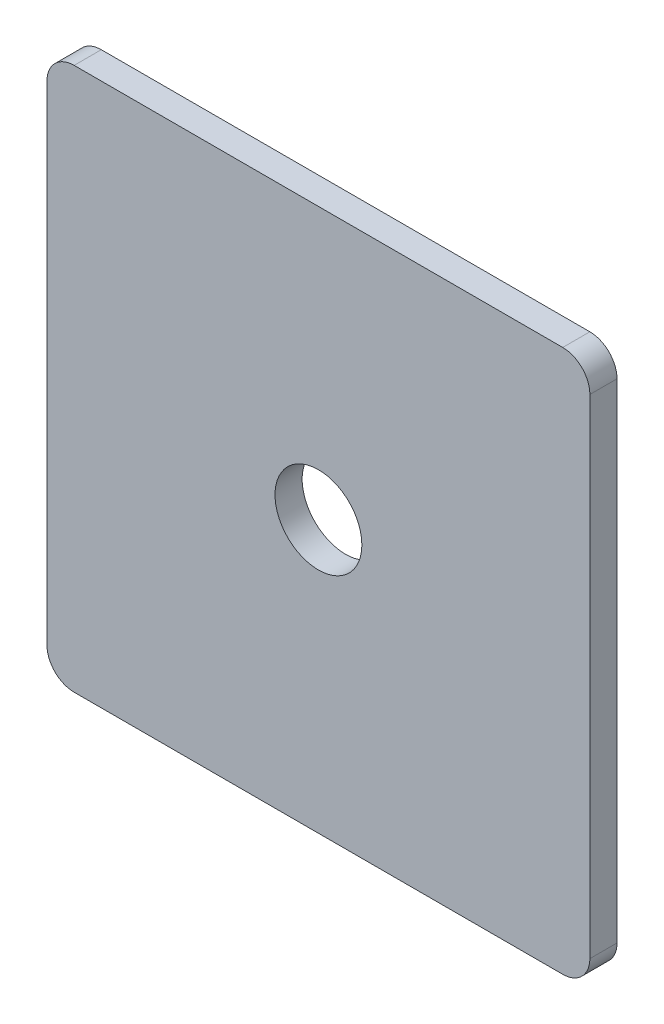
ISO-10303-21;
HEADER;
FILE_DESCRIPTION(('STEP AP214'),'2;1');
FILE_NAME('part.step','',(''),(''),'','','');
FILE_SCHEMA(('AUTOMOTIVE_DESIGN { 1 0 10303 214 1 1 1 1 }'));
ENDSEC;
DATA;
#1=APPLICATION_CONTEXT('core data for automotive mechanical design processes');
#2=APPLICATION_PROTOCOL_DEFINITION('international standard','automotive_design',2000,#1);
#3=PRODUCT_CONTEXT('',#1,'mechanical');
#4=PRODUCT('Part','Part','',(#3));
#5=PRODUCT_RELATED_PRODUCT_CATEGORY('part','',(#4));
#6=PRODUCT_DEFINITION_FORMATION('','',#4);
#7=PRODUCT_DEFINITION_CONTEXT('part definition',#1,'design');
#8=PRODUCT_DEFINITION('design','',#6,#7);
#9=PRODUCT_DEFINITION_SHAPE('','',#8);
#10=(LENGTH_UNIT() NAMED_UNIT(*) SI_UNIT(.MILLI.,.METRE.));
#11=(NAMED_UNIT(*) PLANE_ANGLE_UNIT() SI_UNIT($,.RADIAN.));
#12=(NAMED_UNIT(*) SI_UNIT($,.STERADIAN.) SOLID_ANGLE_UNIT());
#13=UNCERTAINTY_MEASURE_WITH_UNIT(LENGTH_MEASURE(1.E-05),#10,'distance_accuracy_value','');
#14=(GEOMETRIC_REPRESENTATION_CONTEXT(3) GLOBAL_UNCERTAINTY_ASSIGNED_CONTEXT((#13)) GLOBAL_UNIT_ASSIGNED_CONTEXT((#10,
#11,#12)) REPRESENTATION_CONTEXT('',''));
#15=CARTESIAN_POINT('',(0.,0.,0.));
#16=DIRECTION('',(0.,0.,1.));
#17=DIRECTION('',(1.,0.,0.));
#18=AXIS2_PLACEMENT_3D('',#15,#16,#17);
#19=CARTESIAN_POINT('',(0.,0.,5.));
#20=DIRECTION('',(1.,0.,0.));
#21=DIRECTION('',(0.,0.,-1.));
#22=AXIS2_PLACEMENT_3D('',#19,#20,#21);
#23=PLANE('',#22);
#24=DIRECTION('',(0.,-1.,0.));
#25=VECTOR('',#24,1.);
#26=CARTESIAN_POINT('',(0.,0.,0.));
#27=LINE('',#26,#25);
#28=CARTESIAN_POINT('',(0.,95.,0.));
#29=VERTEX_POINT('',#28);
#30=CARTESIAN_POINT('',(0.,5.,0.));
#31=VERTEX_POINT('',#30);
#32=EDGE_CURVE('E143',#29,#31,#27,.T.);
#33=ORIENTED_EDGE('',*,*,#32,.T.);
#34=DIRECTION('',(0.,0.,-1.));
#35=VECTOR('',#34,1.);
#36=CARTESIAN_POINT('',(0.,5.,5.));
#37=LINE('',#36,#35);
#38=CARTESIAN_POINT('',(0.,5.,5.));
#39=VERTEX_POINT('',#38);
#40=EDGE_CURVE('E119',#31,#39,#37,.F.);
#41=ORIENTED_EDGE('',*,*,#40,.T.);
#42=DIRECTION('',(0.,-1.,0.));
#43=VECTOR('',#42,1.);
#44=CARTESIAN_POINT('',(0.,0.,5.));
#45=LINE('',#44,#43);
#46=CARTESIAN_POINT('',(0.,95.,5.));
#47=VERTEX_POINT('',#46);
#48=EDGE_CURVE('E156',#47,#39,#45,.T.);
#49=ORIENTED_EDGE('',*,*,#48,.F.);
#50=DIRECTION('',(0.,0.,-1.));
#51=VECTOR('',#50,1.);
#52=CARTESIAN_POINT('',(0.,95.,5.));
#53=LINE('',#52,#51);
#54=EDGE_CURVE('E124',#47,#29,#53,.T.);
#55=ORIENTED_EDGE('',*,*,#54,.T.);
#56=EDGE_LOOP('',(#33,#41,#49,#55));
#57=FACE_BOUND('',#56,.T.);
#58=ADVANCED_FACE('F43',(#57),#23,.F.);
#59=CARTESIAN_POINT('',(0.,0.,5.));
#60=DIRECTION('',(0.,1.,0.));
#61=DIRECTION('',(0.,0.,1.));
#62=AXIS2_PLACEMENT_3D('',#59,#60,#61);
#63=PLANE('',#62);
#64=DIRECTION('',(1.,0.,0.));
#65=VECTOR('',#64,1.);
#66=CARTESIAN_POINT('',(0.,0.,5.));
#67=LINE('',#66,#65);
#68=CARTESIAN_POINT('',(5.,0.,5.));
#69=VERTEX_POINT('',#68);
#70=CARTESIAN_POINT('',(95.,0.,5.));
#71=VERTEX_POINT('',#70);
#72=EDGE_CURVE('E134',#69,#71,#67,.T.);
#73=ORIENTED_EDGE('',*,*,#72,.F.);
#74=DIRECTION('',(0.,0.,-1.));
#75=VECTOR('',#74,1.);
#76=CARTESIAN_POINT('',(5.,0.,5.));
#77=LINE('',#76,#75);
#78=CARTESIAN_POINT('',(5.,0.,0.));
#79=VERTEX_POINT('',#78);
#80=EDGE_CURVE('E118',#69,#79,#77,.T.);
#81=ORIENTED_EDGE('',*,*,#80,.T.);
#82=DIRECTION('',(1.,0.,0.));
#83=VECTOR('',#82,1.);
#84=CARTESIAN_POINT('',(0.,0.,0.));
#85=LINE('',#84,#83);
#86=CARTESIAN_POINT('',(95.,0.,0.));
#87=VERTEX_POINT('',#86);
#88=EDGE_CURVE('E131',#79,#87,#85,.T.);
#89=ORIENTED_EDGE('',*,*,#88,.T.);
#90=DIRECTION('',(0.,0.,-1.));
#91=VECTOR('',#90,1.);
#92=CARTESIAN_POINT('',(95.,0.,5.));
#93=LINE('',#92,#91);
#94=EDGE_CURVE('E136',#87,#71,#93,.F.);
#95=ORIENTED_EDGE('',*,*,#94,.T.);
#96=EDGE_LOOP('',(#73,#81,#89,#95));
#97=FACE_BOUND('',#96,.T.);
#98=ADVANCED_FACE('F130',(#97),#63,.F.);
#99=CARTESIAN_POINT('',(100.,0.,5.));
#100=DIRECTION('',(-1.,0.,0.));
#101=DIRECTION('',(0.,0.,1.));
#102=AXIS2_PLACEMENT_3D('',#99,#100,#101);
#103=PLANE('',#102);
#104=DIRECTION('',(0.,1.,0.));
#105=VECTOR('',#104,1.);
#106=CARTESIAN_POINT('',(100.,0.,5.));
#107=LINE('',#106,#105);
#108=CARTESIAN_POINT('',(100.,5.,5.));
#109=VERTEX_POINT('',#108);
#110=CARTESIAN_POINT('',(100.,95.,5.));
#111=VERTEX_POINT('',#110);
#112=EDGE_CURVE('E184',#109,#111,#107,.T.);
#113=ORIENTED_EDGE('',*,*,#112,.F.);
#114=DIRECTION('',(0.,0.,-1.));
#115=VECTOR('',#114,1.);
#116=CARTESIAN_POINT('',(100.,5.,5.));
#117=LINE('',#116,#115);
#118=CARTESIAN_POINT('',(100.,5.,0.));
#119=VERTEX_POINT('',#118);
#120=EDGE_CURVE('E11',#109,#119,#117,.T.);
#121=ORIENTED_EDGE('',*,*,#120,.T.);
#122=DIRECTION('',(0.,1.,0.));
#123=VECTOR('',#122,1.);
#124=CARTESIAN_POINT('',(100.,0.,0.));
#125=LINE('',#124,#123);
#126=CARTESIAN_POINT('',(100.,95.,0.));
#127=VERTEX_POINT('',#126);
#128=EDGE_CURVE('E142',#119,#127,#125,.T.);
#129=ORIENTED_EDGE('',*,*,#128,.T.);
#130=DIRECTION('',(0.,0.,-1.));
#131=VECTOR('',#130,1.);
#132=CARTESIAN_POINT('',(100.,95.,5.));
#133=LINE('',#132,#131);
#134=EDGE_CURVE('E51',#127,#111,#133,.F.);
#135=ORIENTED_EDGE('',*,*,#134,.T.);
#136=EDGE_LOOP('',(#113,#121,#129,#135));
#137=FACE_BOUND('',#136,.T.);
#138=ADVANCED_FACE('F183',(#137),#103,.F.);
#139=CARTESIAN_POINT('',(0.,100.,5.));
#140=DIRECTION('',(0.,-1.,0.));
#141=DIRECTION('',(0.,0.,-1.));
#142=AXIS2_PLACEMENT_3D('',#139,#140,#141);
#143=PLANE('',#142);
#144=DIRECTION('',(-1.,0.,0.));
#145=VECTOR('',#144,1.);
#146=CARTESIAN_POINT('',(0.,100.,0.));
#147=LINE('',#146,#145);
#148=CARTESIAN_POINT('',(95.,100.,0.));
#149=VERTEX_POINT('',#148);
#150=CARTESIAN_POINT('',(5.,100.,0.));
#151=VERTEX_POINT('',#150);
#152=EDGE_CURVE('E148',#149,#151,#147,.T.);
#153=ORIENTED_EDGE('',*,*,#152,.T.);
#154=DIRECTION('',(0.,0.,-1.));
#155=VECTOR('',#154,1.);
#156=CARTESIAN_POINT('',(5.,100.,5.));
#157=LINE('',#156,#155);
#158=CARTESIAN_POINT('',(5.,100.,5.));
#159=VERTEX_POINT('',#158);
#160=EDGE_CURVE('E58',#151,#159,#157,.F.);
#161=ORIENTED_EDGE('',*,*,#160,.T.);
#162=DIRECTION('',(-1.,0.,0.));
#163=VECTOR('',#162,1.);
#164=CARTESIAN_POINT('',(0.,100.,5.));
#165=LINE('',#164,#163);
#166=CARTESIAN_POINT('',(95.,100.,5.));
#167=VERTEX_POINT('',#166);
#168=EDGE_CURVE('E157',#167,#159,#165,.T.);
#169=ORIENTED_EDGE('',*,*,#168,.F.);
#170=DIRECTION('',(0.,0.,-1.));
#171=VECTOR('',#170,1.);
#172=CARTESIAN_POINT('',(95.,100.,5.));
#173=LINE('',#172,#171);
#174=EDGE_CURVE('E174',#167,#149,#173,.T.);
#175=ORIENTED_EDGE('',*,*,#174,.T.);
#176=EDGE_LOOP('',(#153,#161,#169,#175));
#177=FACE_BOUND('',#176,.T.);
#178=ADVANCED_FACE('F193',(#177),#143,.F.);
#179=CARTESIAN_POINT('',(0.,100.,5.));
#180=DIRECTION('',(0.,0.,-1.));
#181=DIRECTION('',(-1.,0.,0.));
#182=AXIS2_PLACEMENT_3D('',#179,#180,#181);
#183=PLANE('',#182);
#184=CARTESIAN_POINT('',(50.,50.,5.));
#185=DIRECTION('',(0.,0.,1.));
#186=DIRECTION('',(1.,0.,0.));
#187=AXIS2_PLACEMENT_3D('',#184,#185,#186);
#188=CIRCLE('',#187,8.);
#189=CARTESIAN_POINT('',(58.,50.,5.));
#190=VERTEX_POINT('',#189);
#191=EDGE_CURVE('E203',#190,#190,#188,.T.);
#192=ORIENTED_EDGE('',*,*,#191,.F.);
#193=EDGE_LOOP('',(#192));
#194=FACE_BOUND('',#193,.T.);
#195=ORIENTED_EDGE('',*,*,#48,.T.);
#196=CARTESIAN_POINT('',(5.,5.,5.));
#197=DIRECTION('',(0.,0.,-1.));
#198=DIRECTION('',(-1.,0.,0.));
#199=AXIS2_PLACEMENT_3D('',#196,#197,#198);
#200=CIRCLE('',#199,5.);
#201=EDGE_CURVE('E172',#39,#69,#200,.F.);
#202=ORIENTED_EDGE('',*,*,#201,.T.);
#203=ORIENTED_EDGE('',*,*,#72,.T.);
#204=CARTESIAN_POINT('',(95.,5.,5.));
#205=DIRECTION('',(0.,0.,-1.));
#206=DIRECTION('',(-1.,0.,0.));
#207=AXIS2_PLACEMENT_3D('',#204,#205,#206);
#208=CIRCLE('',#207,5.);
#209=EDGE_CURVE('E168',#71,#109,#208,.F.);
#210=ORIENTED_EDGE('',*,*,#209,.T.);
#211=ORIENTED_EDGE('',*,*,#112,.T.);
#212=CARTESIAN_POINT('',(95.,95.,5.));
#213=DIRECTION('',(0.,0.,-1.));
#214=DIRECTION('',(-1.,0.,0.));
#215=AXIS2_PLACEMENT_3D('',#212,#213,#214);
#216=CIRCLE('',#215,5.);
#217=EDGE_CURVE('E68',#111,#167,#216,.F.);
#218=ORIENTED_EDGE('',*,*,#217,.T.);
#219=ORIENTED_EDGE('',*,*,#168,.T.);
#220=CARTESIAN_POINT('',(5.,95.,5.));
#221=DIRECTION('',(0.,0.,-1.));
#222=DIRECTION('',(-1.,0.,0.));
#223=AXIS2_PLACEMENT_3D('',#220,#221,#222);
#224=CIRCLE('',#223,5.);
#225=EDGE_CURVE('E170',#159,#47,#224,.F.);
#226=ORIENTED_EDGE('',*,*,#225,.T.);
#227=EDGE_LOOP('',(#195,#202,#203,#210,#211,#218,#219,#226));
#228=FACE_BOUND('',#227,.T.);
#229=ADVANCED_FACE('F188',(#194,#228),#183,.F.);
#230=CARTESIAN_POINT('',(0.,100.,0.));
#231=DIRECTION('',(0.,0.,-1.));
#232=DIRECTION('',(-1.,0.,0.));
#233=AXIS2_PLACEMENT_3D('',#230,#231,#232);
#234=PLANE('',#233);
#235=CARTESIAN_POINT('',(50.,50.,0.));
#236=DIRECTION('',(0.,0.,1.));
#237=DIRECTION('',(1.,0.,0.));
#238=AXIS2_PLACEMENT_3D('',#235,#236,#237);
#239=CIRCLE('',#238,8.);
#240=CARTESIAN_POINT('',(58.,50.,0.));
#241=VERTEX_POINT('',#240);
#242=EDGE_CURVE('E150',#241,#241,#239,.T.);
#243=ORIENTED_EDGE('',*,*,#242,.T.);
#244=EDGE_LOOP('',(#243));
#245=FACE_BOUND('',#244,.T.);
#246=ORIENTED_EDGE('',*,*,#88,.F.);
#247=CARTESIAN_POINT('',(5.,5.,0.));
#248=DIRECTION('',(0.,0.,-1.));
#249=DIRECTION('',(-1.,0.,0.));
#250=AXIS2_PLACEMENT_3D('',#247,#248,#249);
#251=CIRCLE('',#250,5.);
#252=EDGE_CURVE('E114',#79,#31,#251,.T.);
#253=ORIENTED_EDGE('',*,*,#252,.T.);
#254=ORIENTED_EDGE('',*,*,#32,.F.);
#255=CARTESIAN_POINT('',(5.,95.,0.));
#256=DIRECTION('',(0.,0.,-1.));
#257=DIRECTION('',(-1.,0.,0.));
#258=AXIS2_PLACEMENT_3D('',#255,#256,#257);
#259=CIRCLE('',#258,5.);
#260=EDGE_CURVE('E125',#29,#151,#259,.T.);
#261=ORIENTED_EDGE('',*,*,#260,.T.);
#262=ORIENTED_EDGE('',*,*,#152,.F.);
#263=CARTESIAN_POINT('',(95.,95.,0.));
#264=DIRECTION('',(0.,0.,-1.));
#265=DIRECTION('',(-1.,0.,0.));
#266=AXIS2_PLACEMENT_3D('',#263,#264,#265);
#267=CIRCLE('',#266,5.);
#268=EDGE_CURVE('E135',#149,#127,#267,.T.);
#269=ORIENTED_EDGE('',*,*,#268,.T.);
#270=ORIENTED_EDGE('',*,*,#128,.F.);
#271=CARTESIAN_POINT('',(95.,5.,0.));
#272=DIRECTION('',(0.,0.,-1.));
#273=DIRECTION('',(-1.,0.,0.));
#274=AXIS2_PLACEMENT_3D('',#271,#272,#273);
#275=CIRCLE('',#274,5.);
#276=EDGE_CURVE('E140',#119,#87,#275,.T.);
#277=ORIENTED_EDGE('',*,*,#276,.T.);
#278=EDGE_LOOP('',(#246,#253,#254,#261,#262,#269,#270,#277));
#279=FACE_BOUND('',#278,.T.);
#280=ADVANCED_FACE('F138',(#245,#279),#234,.T.);
#281=CARTESIAN_POINT('',(50.,50.,0.));
#282=DIRECTION('',(0.,0.,1.));
#283=DIRECTION('',(1.,0.,0.));
#284=AXIS2_PLACEMENT_3D('',#281,#282,#283);
#285=CYLINDRICAL_SURFACE('',#284,8.);
#286=ORIENTED_EDGE('',*,*,#242,.F.);
#287=EDGE_LOOP('',(#286));
#288=FACE_BOUND('',#287,.T.);
#289=ORIENTED_EDGE('',*,*,#191,.T.);
#290=EDGE_LOOP('',(#289));
#291=FACE_BOUND('',#290,.T.);
#292=ADVANCED_FACE('F211',(#288,#291),#285,.F.);
#293=CARTESIAN_POINT('',(5.,5.,5.));
#294=DIRECTION('',(0.,0.,-1.));
#295=DIRECTION('',(-1.,0.,0.));
#296=AXIS2_PLACEMENT_3D('',#293,#294,#295);
#297=CYLINDRICAL_SURFACE('',#296,5.);
#298=ORIENTED_EDGE('',*,*,#201,.F.);
#299=ORIENTED_EDGE('',*,*,#40,.F.);
#300=ORIENTED_EDGE('',*,*,#252,.F.);
#301=ORIENTED_EDGE('',*,*,#80,.F.);
#302=EDGE_LOOP('',(#298,#299,#300,#301));
#303=FACE_BOUND('',#302,.T.);
#304=ADVANCED_FACE('F117',(#303),#297,.T.);
#305=CARTESIAN_POINT('',(5.,95.,5.));
#306=DIRECTION('',(0.,0.,-1.));
#307=DIRECTION('',(-1.,0.,0.));
#308=AXIS2_PLACEMENT_3D('',#305,#306,#307);
#309=CYLINDRICAL_SURFACE('',#308,5.);
#310=ORIENTED_EDGE('',*,*,#225,.F.);
#311=ORIENTED_EDGE('',*,*,#160,.F.);
#312=ORIENTED_EDGE('',*,*,#260,.F.);
#313=ORIENTED_EDGE('',*,*,#54,.F.);
#314=EDGE_LOOP('',(#310,#311,#312,#313));
#315=FACE_BOUND('',#314,.T.);
#316=ADVANCED_FACE('F197',(#315),#309,.T.);
#317=CARTESIAN_POINT('',(95.,5.,5.));
#318=DIRECTION('',(0.,0.,-1.));
#319=DIRECTION('',(-1.,0.,0.));
#320=AXIS2_PLACEMENT_3D('',#317,#318,#319);
#321=CYLINDRICAL_SURFACE('',#320,5.);
#322=ORIENTED_EDGE('',*,*,#209,.F.);
#323=ORIENTED_EDGE('',*,*,#94,.F.);
#324=ORIENTED_EDGE('',*,*,#276,.F.);
#325=ORIENTED_EDGE('',*,*,#120,.F.);
#326=EDGE_LOOP('',(#322,#323,#324,#325));
#327=FACE_BOUND('',#326,.T.);
#328=ADVANCED_FACE('F236',(#327),#321,.T.);
#329=CARTESIAN_POINT('',(95.,95.,5.));
#330=DIRECTION('',(0.,0.,-1.));
#331=DIRECTION('',(-1.,0.,0.));
#332=AXIS2_PLACEMENT_3D('',#329,#330,#331);
#333=CYLINDRICAL_SURFACE('',#332,5.);
#334=ORIENTED_EDGE('',*,*,#217,.F.);
#335=ORIENTED_EDGE('',*,*,#134,.F.);
#336=ORIENTED_EDGE('',*,*,#268,.F.);
#337=ORIENTED_EDGE('',*,*,#174,.F.);
#338=EDGE_LOOP('',(#334,#335,#336,#337));
#339=FACE_BOUND('',#338,.T.);
#340=ADVANCED_FACE('F45',(#339),#333,.T.);
#341=CLOSED_SHELL('',(#58,#98,#138,#178,#229,#280,#292,#304,#316,#328,#340));
#342=MANIFOLD_SOLID_BREP('B2',#341);
#343=ADVANCED_BREP_SHAPE_REPRESENTATION('',(#18,#342),#14);
#344=SHAPE_DEFINITION_REPRESENTATION(#9,#343);
ENDSEC;
END-ISO-10303-21;
